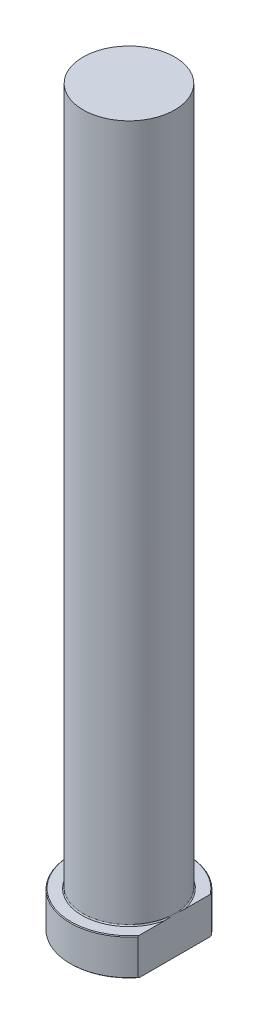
from build123d import *
from build123d.topology import SkipClean

# Parameters (mm, degrees)
CHAMFER1_SIZE = 0.2
FILLET1_R     = 0.3
KEY_DEPTH     = 202.275930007


with BuildPart() as part:
    # Sketch1 → Revolve1 (revolve)
    with BuildSketch(Plane.XY, mode=Mode.PRIVATE) as revolve1_sk:
        Polygon((0, 0), (-16, 0), (-16, 10), (-12.5, 10), (-12.5, 200), (0, 200), align=None)
    revolve(revolve1_sk.sketch.rotate(Axis((0, 259.958771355, 0), (0, -1, 0)), 270), axis=Axis((0, 259.958771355, 0), (0, -1, 0)))

    # Chamfer1
    chamfer1_edges = [part.edges().sort_by_distance(p)[0] for p in [
        (0, 10, -16),
        (0, 0, -16),
    ]]
    chamfer(chamfer1_edges, length=CHAMFER1_SIZE)

    # Fillet1
    fillet1_edges = [part.edges().sort_by_distance(p)[0] for p in [
        (0, 10, -12.5),
    ]]
    fillet(fillet1_edges, radius=FILLET1_R)

    # Sketch2 → KEY (cut, through all)
    with SkipClean():  # the faces are left unmerged after this step: merging them gives an invalid solid
        with BuildSketch(Plane(origin=(0, 0, 0), x_dir=(1, 0, 0), z_dir=(0, 1, 0))):
            with BuildLine():
                Line((12.5, 9.987492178), (12.5, -9.987492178))
                ThreePointArc((12.5, -9.987492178), (16, 0), (12.5, 9.987492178))
            make_face()
        extrude(amount=KEY_DEPTH, mode=Mode.SUBTRACT)


solid = part.part
